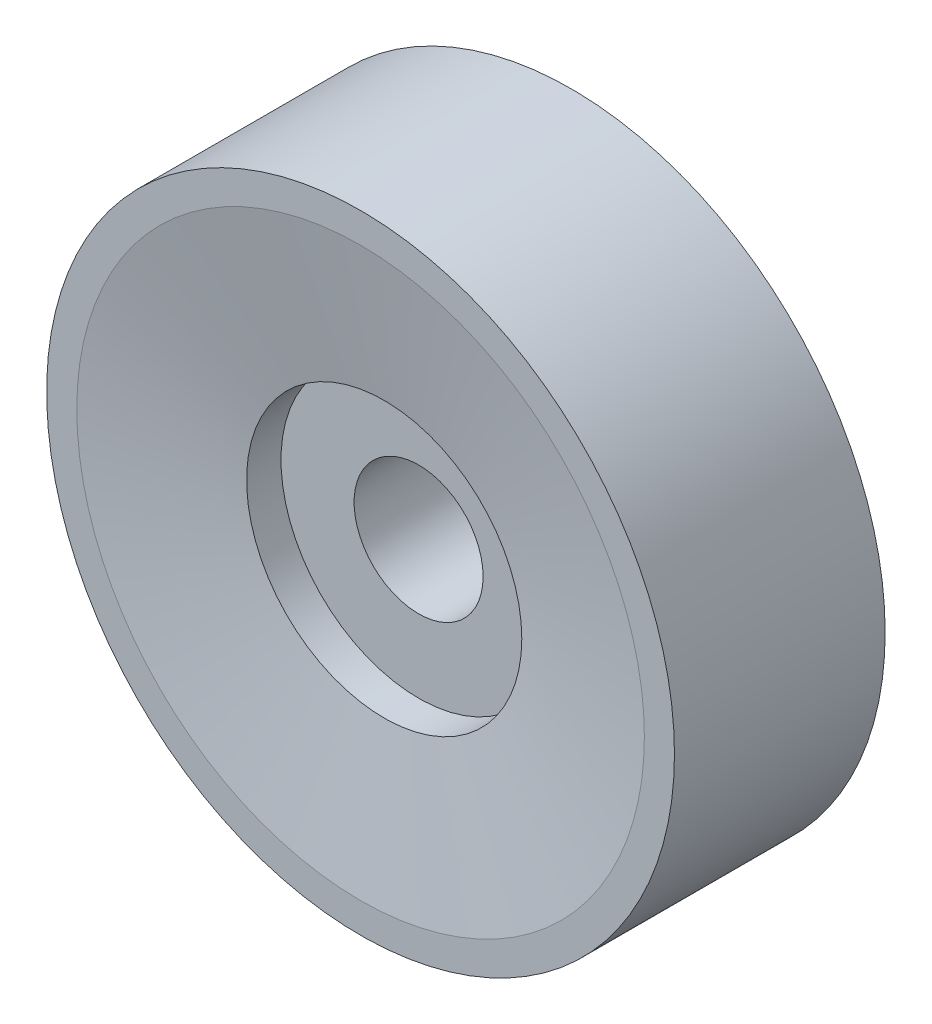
ISO-10303-21;
HEADER;
FILE_DESCRIPTION(('STEP AP214'),'2;1');
FILE_NAME('part.step','',(''),(''),'','','');
FILE_SCHEMA(('AUTOMOTIVE_DESIGN { 1 0 10303 214 1 1 1 1 }'));
ENDSEC;
DATA;
#1=APPLICATION_CONTEXT('core data for automotive mechanical design processes');
#2=APPLICATION_PROTOCOL_DEFINITION('international standard','automotive_design',2000,#1);
#3=PRODUCT_CONTEXT('',#1,'mechanical');
#4=PRODUCT('Part','Part','',(#3));
#5=PRODUCT_RELATED_PRODUCT_CATEGORY('part','',(#4));
#6=PRODUCT_DEFINITION_FORMATION('','',#4);
#7=PRODUCT_DEFINITION_CONTEXT('part definition',#1,'design');
#8=PRODUCT_DEFINITION('design','',#6,#7);
#9=PRODUCT_DEFINITION_SHAPE('','',#8);
#10=(LENGTH_UNIT() NAMED_UNIT(*) SI_UNIT(.MILLI.,.METRE.));
#11=(NAMED_UNIT(*) PLANE_ANGLE_UNIT() SI_UNIT($,.RADIAN.));
#12=(NAMED_UNIT(*) SI_UNIT($,.STERADIAN.) SOLID_ANGLE_UNIT());
#13=UNCERTAINTY_MEASURE_WITH_UNIT(LENGTH_MEASURE(1.E-05),#10,'distance_accuracy_value','');
#14=(GEOMETRIC_REPRESENTATION_CONTEXT(3) GLOBAL_UNCERTAINTY_ASSIGNED_CONTEXT((#13)) GLOBAL_UNIT_ASSIGNED_CONTEXT((#10,
#11,#12)) REPRESENTATION_CONTEXT('',''));
#15=CARTESIAN_POINT('',(0.,0.,0.));
#16=DIRECTION('',(0.,0.,1.));
#17=DIRECTION('',(1.,0.,0.));
#18=AXIS2_PLACEMENT_3D('',#15,#16,#17);
#19=CARTESIAN_POINT('',(0.,-42.25,12.25));
#20=DIRECTION('',(0.,0.,1.));
#21=DIRECTION('',(-1.,0.,0.));
#22=AXIS2_PLACEMENT_3D('',#19,#20,#21);
#23=PLANE('',#22);
#24=CARTESIAN_POINT('',(0.,0.,12.25));
#25=DIRECTION('',(0.,0.,-1.));
#26=DIRECTION('',(1.,0.,0.));
#27=AXIS2_PLACEMENT_3D('',#24,#25,#26);
#28=CIRCLE('',#27,33.);
#29=CARTESIAN_POINT('',(33.,0.,12.25));
#30=VERTEX_POINT('',#29);
#31=EDGE_CURVE('E32',#30,#30,#28,.T.);
#32=ORIENTED_EDGE('',*,*,#31,.T.);
#33=EDGE_LOOP('',(#32));
#34=FACE_BOUND('',#33,.T.);
#35=CARTESIAN_POINT('',(0.,0.,12.25));
#36=DIRECTION('',(0.,0.,1.));
#37=DIRECTION('',(1.,0.,0.));
#38=AXIS2_PLACEMENT_3D('',#35,#36,#37);
#39=CIRCLE('',#38,36.5);
#40=CARTESIAN_POINT('',(36.5,0.,12.25));
#41=VERTEX_POINT('',#40);
#42=EDGE_CURVE('E45',#41,#41,#39,.T.);
#43=ORIENTED_EDGE('',*,*,#42,.T.);
#44=EDGE_LOOP('',(#43));
#45=FACE_BOUND('',#44,.T.);
#46=ADVANCED_FACE('F12',(#34,#45),#23,.T.);
#47=CARTESIAN_POINT('',(0.,-42.25,-12.25));
#48=DIRECTION('',(0.,0.,1.));
#49=DIRECTION('',(-1.,0.,0.));
#50=AXIS2_PLACEMENT_3D('',#47,#48,#49);
#51=PLANE('',#50);
#52=CARTESIAN_POINT('',(0.,0.,-12.25));
#53=DIRECTION('',(0.,0.,-1.));
#54=DIRECTION('',(1.,0.,0.));
#55=AXIS2_PLACEMENT_3D('',#52,#53,#54);
#56=CIRCLE('',#55,33.);
#57=CARTESIAN_POINT('',(33.,0.,-12.25));
#58=VERTEX_POINT('',#57);
#59=EDGE_CURVE('E35',#58,#58,#56,.T.);
#60=ORIENTED_EDGE('',*,*,#59,.F.);
#61=EDGE_LOOP('',(#60));
#62=FACE_BOUND('',#61,.T.);
#63=CARTESIAN_POINT('',(0.,0.,-12.25));
#64=DIRECTION('',(0.,0.,1.));
#65=DIRECTION('',(1.,0.,0.));
#66=AXIS2_PLACEMENT_3D('',#63,#64,#65);
#67=CIRCLE('',#66,36.5);
#68=CARTESIAN_POINT('',(36.5,0.,-12.25));
#69=VERTEX_POINT('',#68);
#70=EDGE_CURVE('E44',#69,#69,#67,.T.);
#71=ORIENTED_EDGE('',*,*,#70,.F.);
#72=EDGE_LOOP('',(#71));
#73=FACE_BOUND('',#72,.T.);
#74=ADVANCED_FACE('F54',(#62,#73),#51,.F.);
#75=CARTESIAN_POINT('',(0.,-7.5,-5.5));
#76=DIRECTION('',(0.,0.,-1.));
#77=DIRECTION('',(1.,0.,0.));
#78=AXIS2_PLACEMENT_3D('',#75,#76,#77);
#79=PLANE('',#78);
#80=CARTESIAN_POINT('',(0.,0.,-5.5));
#81=DIRECTION('',(0.,0.,-1.));
#82=DIRECTION('',(1.,0.,0.));
#83=AXIS2_PLACEMENT_3D('',#80,#81,#82);
#84=CIRCLE('',#83,16.);
#85=CARTESIAN_POINT('',(16.,0.,-5.5));
#86=VERTEX_POINT('',#85);
#87=EDGE_CURVE('E41',#86,#86,#84,.T.);
#88=ORIENTED_EDGE('',*,*,#87,.T.);
#89=EDGE_LOOP('',(#88));
#90=FACE_BOUND('',#89,.T.);
#91=CARTESIAN_POINT('',(0.,0.,-5.5));
#92=DIRECTION('',(0.,0.,-1.));
#93=DIRECTION('',(1.,0.,0.));
#94=AXIS2_PLACEMENT_3D('',#91,#92,#93);
#95=CIRCLE('',#94,7.5);
#96=CARTESIAN_POINT('',(7.5,0.,-5.5));
#97=VERTEX_POINT('',#96);
#98=EDGE_CURVE('E8',#97,#97,#95,.T.);
#99=ORIENTED_EDGE('',*,*,#98,.F.);
#100=EDGE_LOOP('',(#99));
#101=FACE_BOUND('',#100,.T.);
#102=ADVANCED_FACE('F14',(#90,#101),#79,.T.);
#103=CARTESIAN_POINT('',(0.,0.,-20.));
#104=DIRECTION('',(0.,0.,-1.));
#105=DIRECTION('',(1.,0.,0.));
#106=AXIS2_PLACEMENT_3D('',#103,#104,#105);
#107=CYLINDRICAL_SURFACE('',#106,7.5);
#108=ORIENTED_EDGE('',*,*,#98,.T.);
#109=EDGE_LOOP('',(#108));
#110=FACE_BOUND('',#109,.T.);
#111=CARTESIAN_POINT('',(0.,0.,5.5));
#112=DIRECTION('',(0.,0.,-1.));
#113=DIRECTION('',(1.,0.,0.));
#114=AXIS2_PLACEMENT_3D('',#111,#112,#113);
#115=CIRCLE('',#114,7.5);
#116=CARTESIAN_POINT('',(7.5,0.,5.5));
#117=VERTEX_POINT('',#116);
#118=EDGE_CURVE('E19',#117,#117,#115,.T.);
#119=ORIENTED_EDGE('',*,*,#118,.F.);
#120=EDGE_LOOP('',(#119));
#121=FACE_BOUND('',#120,.T.);
#122=ADVANCED_FACE('F64',(#110,#121),#107,.F.);
#123=CARTESIAN_POINT('',(0.,-7.5,5.5));
#124=DIRECTION('',(0.,0.,-1.));
#125=DIRECTION('',(1.,0.,0.));
#126=AXIS2_PLACEMENT_3D('',#123,#124,#125);
#127=PLANE('',#126);
#128=CARTESIAN_POINT('',(0.,0.,5.5));
#129=DIRECTION('',(0.,0.,-1.));
#130=DIRECTION('',(1.,0.,0.));
#131=AXIS2_PLACEMENT_3D('',#128,#129,#130);
#132=CIRCLE('',#131,16.);
#133=CARTESIAN_POINT('',(16.,0.,5.5));
#134=VERTEX_POINT('',#133);
#135=EDGE_CURVE('E23',#134,#134,#132,.T.);
#136=ORIENTED_EDGE('',*,*,#135,.F.);
#137=EDGE_LOOP('',(#136));
#138=FACE_BOUND('',#137,.T.);
#139=ORIENTED_EDGE('',*,*,#118,.T.);
#140=EDGE_LOOP('',(#139));
#141=FACE_BOUND('',#140,.T.);
#142=ADVANCED_FACE('F80',(#138,#141),#127,.F.);
#143=CARTESIAN_POINT('',(0.,0.,-20.));
#144=DIRECTION('',(0.,0.,-1.));
#145=DIRECTION('',(1.,0.,0.));
#146=AXIS2_PLACEMENT_3D('',#143,#144,#145);
#147=CYLINDRICAL_SURFACE('',#146,16.);
#148=CARTESIAN_POINT('',(0.,0.,9.5));
#149=DIRECTION('',(0.,0.,-1.));
#150=DIRECTION('',(1.,0.,0.));
#151=AXIS2_PLACEMENT_3D('',#148,#149,#150);
#152=CIRCLE('',#151,16.);
#153=CARTESIAN_POINT('',(16.,0.,9.5));
#154=VERTEX_POINT('',#153);
#155=EDGE_CURVE('E27',#154,#154,#152,.T.);
#156=ORIENTED_EDGE('',*,*,#155,.F.);
#157=EDGE_LOOP('',(#156));
#158=FACE_BOUND('',#157,.T.);
#159=ORIENTED_EDGE('',*,*,#135,.T.);
#160=EDGE_LOOP('',(#159));
#161=FACE_BOUND('',#160,.T.);
#162=ADVANCED_FACE('F76',(#158,#161),#147,.F.);
#163=CARTESIAN_POINT('',(0.,0.,9.5));
#164=DIRECTION('',(0.,0.,1.));
#165=DIRECTION('',(-1.,0.,0.));
#166=AXIS2_PLACEMENT_3D('',#163,#164,#165);
#167=CONICAL_SURFACE('',#166,16.,1.41042088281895);
#168=ORIENTED_EDGE('',*,*,#31,.F.);
#169=EDGE_LOOP('',(#168));
#170=FACE_BOUND('',#169,.T.);
#171=ORIENTED_EDGE('',*,*,#155,.T.);
#172=EDGE_LOOP('',(#171));
#173=FACE_BOUND('',#172,.T.);
#174=ADVANCED_FACE('F73',(#170,#173),#167,.F.);
#175=CARTESIAN_POINT('',(0.,0.,-9.5));
#176=DIRECTION('',(0.,0.,-1.));
#177=DIRECTION('',(1.,0.,0.));
#178=AXIS2_PLACEMENT_3D('',#175,#176,#177);
#179=CONICAL_SURFACE('',#178,16.,1.41042088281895);
#180=ORIENTED_EDGE('',*,*,#59,.T.);
#181=EDGE_LOOP('',(#180));
#182=FACE_BOUND('',#181,.T.);
#183=CARTESIAN_POINT('',(0.,0.,-9.5));
#184=DIRECTION('',(0.,0.,-1.));
#185=DIRECTION('',(1.,0.,0.));
#186=AXIS2_PLACEMENT_3D('',#183,#184,#185);
#187=CIRCLE('',#186,16.);
#188=CARTESIAN_POINT('',(16.,0.,-9.5));
#189=VERTEX_POINT('',#188);
#190=EDGE_CURVE('E38',#189,#189,#187,.T.);
#191=ORIENTED_EDGE('',*,*,#190,.F.);
#192=EDGE_LOOP('',(#191));
#193=FACE_BOUND('',#192,.T.);
#194=ADVANCED_FACE('F70',(#182,#193),#179,.F.);
#195=CARTESIAN_POINT('',(0.,0.,-20.));
#196=DIRECTION('',(0.,0.,-1.));
#197=DIRECTION('',(1.,0.,0.));
#198=AXIS2_PLACEMENT_3D('',#195,#196,#197);
#199=CYLINDRICAL_SURFACE('',#198,16.);
#200=ORIENTED_EDGE('',*,*,#190,.T.);
#201=EDGE_LOOP('',(#200));
#202=FACE_BOUND('',#201,.T.);
#203=ORIENTED_EDGE('',*,*,#87,.F.);
#204=EDGE_LOOP('',(#203));
#205=FACE_BOUND('',#204,.T.);
#206=ADVANCED_FACE('F118',(#202,#205),#199,.F.);
#207=CARTESIAN_POINT('',(0.,0.,-12.25));
#208=DIRECTION('',(0.,0.,1.));
#209=DIRECTION('',(1.,0.,0.));
#210=AXIS2_PLACEMENT_3D('',#207,#208,#209);
#211=CYLINDRICAL_SURFACE('',#210,36.5);
#212=ORIENTED_EDGE('',*,*,#70,.T.);
#213=EDGE_LOOP('',(#212));
#214=FACE_BOUND('',#213,.T.);
#215=ORIENTED_EDGE('',*,*,#42,.F.);
#216=EDGE_LOOP('',(#215));
#217=FACE_BOUND('',#216,.T.);
#218=ADVANCED_FACE('F51',(#214,#217),#211,.T.);
#219=CLOSED_SHELL('',(#46,#74,#102,#122,#142,#162,#174,#194,#206,#218));
#220=MANIFOLD_SOLID_BREP('B1',#219);
#221=ADVANCED_BREP_SHAPE_REPRESENTATION('',(#18,#220),#14);
#222=SHAPE_DEFINITION_REPRESENTATION(#9,#221);
ENDSEC;
END-ISO-10303-21;
